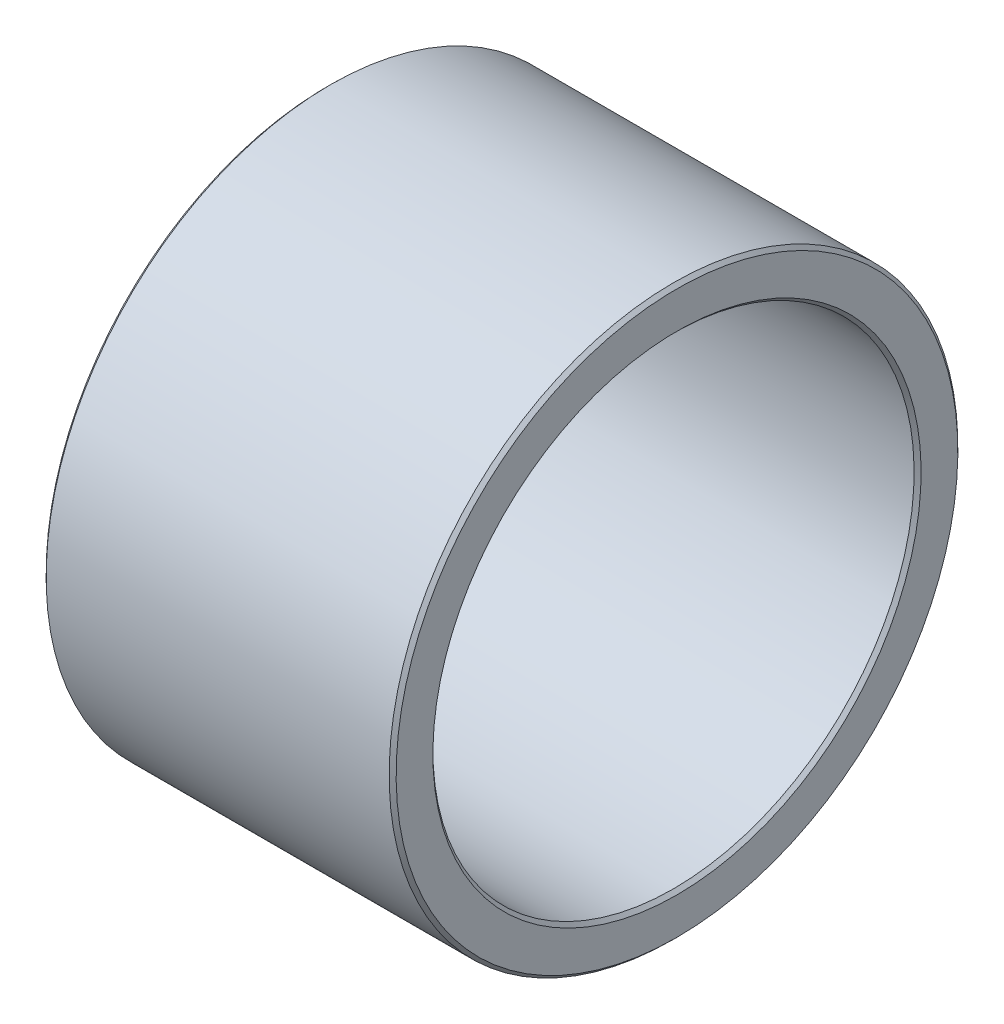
ISO-10303-21;
HEADER;
FILE_DESCRIPTION(('STEP AP214'),'2;1');
FILE_NAME('part.step','',(''),(''),'','','');
FILE_SCHEMA(('AUTOMOTIVE_DESIGN { 1 0 10303 214 1 1 1 1 }'));
ENDSEC;
DATA;
#1=APPLICATION_CONTEXT('core data for automotive mechanical design processes');
#2=APPLICATION_PROTOCOL_DEFINITION('international standard','automotive_design',2000,#1);
#3=PRODUCT_CONTEXT('',#1,'mechanical');
#4=PRODUCT('Part','Part','',(#3));
#5=PRODUCT_RELATED_PRODUCT_CATEGORY('part','',(#4));
#6=PRODUCT_DEFINITION_FORMATION('','',#4);
#7=PRODUCT_DEFINITION_CONTEXT('part definition',#1,'design');
#8=PRODUCT_DEFINITION('design','',#6,#7);
#9=PRODUCT_DEFINITION_SHAPE('','',#8);
#10=(LENGTH_UNIT() NAMED_UNIT(*) SI_UNIT(.MILLI.,.METRE.));
#11=(NAMED_UNIT(*) PLANE_ANGLE_UNIT() SI_UNIT($,.RADIAN.));
#12=(NAMED_UNIT(*) SI_UNIT($,.STERADIAN.) SOLID_ANGLE_UNIT());
#13=UNCERTAINTY_MEASURE_WITH_UNIT(LENGTH_MEASURE(1.E-05),#10,'distance_accuracy_value','');
#14=(GEOMETRIC_REPRESENTATION_CONTEXT(3) GLOBAL_UNCERTAINTY_ASSIGNED_CONTEXT((#13)) GLOBAL_UNIT_ASSIGNED_CONTEXT((#10,
#11,#12)) REPRESENTATION_CONTEXT('',''));
#15=CARTESIAN_POINT('',(0.,0.,0.));
#16=DIRECTION('',(0.,0.,1.));
#17=DIRECTION('',(1.,0.,0.));
#18=AXIS2_PLACEMENT_3D('',#15,#16,#17);
#19=CARTESIAN_POINT('',(0.,-30.,0.));
#20=DIRECTION('',(-1.,0.,0.));
#21=DIRECTION('',(0.,1.,0.));
#22=AXIS2_PLACEMENT_3D('',#19,#20,#21);
#23=PLANE('',#22);
#24=CARTESIAN_POINT('',(0.,0.,0.));
#25=DIRECTION('',(1.,0.,0.));
#26=DIRECTION('',(0.,-1.,0.));
#27=AXIS2_PLACEMENT_3D('',#24,#25,#26);
#28=CIRCLE('',#27,27.9);
#29=CARTESIAN_POINT('',(0.,-27.9,0.));
#30=VERTEX_POINT('',#29);
#31=EDGE_CURVE('E9',#30,#30,#28,.T.);
#32=ORIENTED_EDGE('',*,*,#31,.T.);
#33=EDGE_LOOP('',(#32));
#34=FACE_BOUND('',#33,.T.);
#35=CARTESIAN_POINT('',(0.,0.,0.));
#36=DIRECTION('',(1.,0.,0.));
#37=DIRECTION('',(0.,-1.,0.));
#38=AXIS2_PLACEMENT_3D('',#35,#36,#37);
#39=CIRCLE('',#38,32.1);
#40=CARTESIAN_POINT('',(0.,-32.1,0.));
#41=VERTEX_POINT('',#40);
#42=EDGE_CURVE('E53',#41,#41,#39,.T.);
#43=ORIENTED_EDGE('',*,*,#42,.F.);
#44=EDGE_LOOP('',(#43));
#45=FACE_BOUND('',#44,.T.);
#46=ADVANCED_FACE('F15',(#34,#45),#23,.T.);
#47=CARTESIAN_POINT('',(0.2,0.,0.));
#48=DIRECTION('',(-1.,0.,0.));
#49=DIRECTION('',(0.,-1.,0.));
#50=AXIS2_PLACEMENT_3D('',#47,#48,#49);
#51=CONICAL_SURFACE('',#50,27.7,0.78539816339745);
#52=CARTESIAN_POINT('',(0.4,0.,0.));
#53=DIRECTION('',(1.,0.,0.));
#54=DIRECTION('',(0.,-1.,0.));
#55=AXIS2_PLACEMENT_3D('',#52,#53,#54);
#56=CIRCLE('',#55,27.5);
#57=CARTESIAN_POINT('',(0.4,-27.5,0.));
#58=VERTEX_POINT('',#57);
#59=EDGE_CURVE('E22',#58,#58,#56,.T.);
#60=ORIENTED_EDGE('',*,*,#59,.T.);
#61=EDGE_LOOP('',(#60));
#62=FACE_BOUND('',#61,.T.);
#63=ORIENTED_EDGE('',*,*,#31,.F.);
#64=EDGE_LOOP('',(#63));
#65=FACE_BOUND('',#64,.T.);
#66=ADVANCED_FACE('F82',(#62,#65),#51,.F.);
#67=CARTESIAN_POINT('',(20.,0.,0.));
#68=DIRECTION('',(-1.,0.,0.));
#69=DIRECTION('',(0.,-1.,0.));
#70=AXIS2_PLACEMENT_3D('',#67,#68,#69);
#71=CYLINDRICAL_SURFACE('',#70,27.5);
#72=CARTESIAN_POINT('',(39.6,0.,0.));
#73=DIRECTION('',(1.,0.,0.));
#74=DIRECTION('',(0.,-1.,0.));
#75=AXIS2_PLACEMENT_3D('',#72,#73,#74);
#76=CIRCLE('',#75,27.5);
#77=CARTESIAN_POINT('',(39.6,-27.5,0.));
#78=VERTEX_POINT('',#77);
#79=EDGE_CURVE('E58',#78,#78,#76,.T.);
#80=ORIENTED_EDGE('',*,*,#79,.T.);
#81=EDGE_LOOP('',(#80));
#82=FACE_BOUND('',#81,.T.);
#83=ORIENTED_EDGE('',*,*,#59,.F.);
#84=EDGE_LOOP('',(#83));
#85=FACE_BOUND('',#84,.T.);
#86=ADVANCED_FACE('F66',(#82,#85),#71,.F.);
#87=CARTESIAN_POINT('',(39.8,0.,0.));
#88=DIRECTION('',(1.,0.,0.));
#89=DIRECTION('',(0.,-1.,0.));
#90=AXIS2_PLACEMENT_3D('',#87,#88,#89);
#91=CONICAL_SURFACE('',#90,27.7,0.785398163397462);
#92=CARTESIAN_POINT('',(40.,0.,0.));
#93=DIRECTION('',(1.,0.,0.));
#94=DIRECTION('',(0.,-1.,0.));
#95=AXIS2_PLACEMENT_3D('',#92,#93,#94);
#96=CIRCLE('',#95,27.9);
#97=CARTESIAN_POINT('',(40.,-27.9,0.));
#98=VERTEX_POINT('',#97);
#99=EDGE_CURVE('E63',#98,#98,#96,.T.);
#100=ORIENTED_EDGE('',*,*,#99,.T.);
#101=EDGE_LOOP('',(#100));
#102=FACE_BOUND('',#101,.T.);
#103=ORIENTED_EDGE('',*,*,#79,.F.);
#104=EDGE_LOOP('',(#103));
#105=FACE_BOUND('',#104,.T.);
#106=ADVANCED_FACE('F69',(#102,#105),#91,.F.);
#107=CARTESIAN_POINT('',(40.,-30.,0.));
#108=DIRECTION('',(1.,0.,0.));
#109=DIRECTION('',(0.,-1.,0.));
#110=AXIS2_PLACEMENT_3D('',#107,#108,#109);
#111=PLANE('',#110);
#112=CARTESIAN_POINT('',(40.,0.,0.));
#113=DIRECTION('',(1.,0.,0.));
#114=DIRECTION('',(0.,-1.,0.));
#115=AXIS2_PLACEMENT_3D('',#112,#113,#114);
#116=CIRCLE('',#115,32.1);
#117=CARTESIAN_POINT('',(40.,-32.1,0.));
#118=VERTEX_POINT('',#117);
#119=EDGE_CURVE('E61',#118,#118,#116,.T.);
#120=ORIENTED_EDGE('',*,*,#119,.T.);
#121=EDGE_LOOP('',(#120));
#122=FACE_BOUND('',#121,.T.);
#123=ORIENTED_EDGE('',*,*,#99,.F.);
#124=EDGE_LOOP('',(#123));
#125=FACE_BOUND('',#124,.T.);
#126=ADVANCED_FACE('F71',(#122,#125),#111,.T.);
#127=CARTESIAN_POINT('',(39.8,0.,0.));
#128=DIRECTION('',(-1.,0.,0.));
#129=DIRECTION('',(0.,-1.,0.));
#130=AXIS2_PLACEMENT_3D('',#127,#128,#129);
#131=CONICAL_SURFACE('',#130,32.3,0.785398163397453);
#132=CARTESIAN_POINT('',(39.6,0.,0.));
#133=DIRECTION('',(1.,0.,0.));
#134=DIRECTION('',(0.,-1.,0.));
#135=AXIS2_PLACEMENT_3D('',#132,#133,#134);
#136=CIRCLE('',#135,32.5);
#137=CARTESIAN_POINT('',(39.6,-32.5,0.));
#138=VERTEX_POINT('',#137);
#139=EDGE_CURVE('E55',#138,#138,#136,.T.);
#140=ORIENTED_EDGE('',*,*,#139,.T.);
#141=EDGE_LOOP('',(#140));
#142=FACE_BOUND('',#141,.T.);
#143=ORIENTED_EDGE('',*,*,#119,.F.);
#144=EDGE_LOOP('',(#143));
#145=FACE_BOUND('',#144,.T.);
#146=ADVANCED_FACE('F79',(#142,#145),#131,.T.);
#147=CARTESIAN_POINT('',(20.,0.,0.));
#148=DIRECTION('',(-1.,0.,0.));
#149=DIRECTION('',(0.,-1.,0.));
#150=AXIS2_PLACEMENT_3D('',#147,#148,#149);
#151=CYLINDRICAL_SURFACE('',#150,32.5);
#152=CARTESIAN_POINT('',(0.4,0.,0.));
#153=DIRECTION('',(1.,0.,0.));
#154=DIRECTION('',(0.,-1.,0.));
#155=AXIS2_PLACEMENT_3D('',#152,#153,#154);
#156=CIRCLE('',#155,32.5);
#157=CARTESIAN_POINT('',(0.4,-32.5,0.));
#158=VERTEX_POINT('',#157);
#159=EDGE_CURVE('E49',#158,#158,#156,.T.);
#160=ORIENTED_EDGE('',*,*,#159,.T.);
#161=EDGE_LOOP('',(#160));
#162=FACE_BOUND('',#161,.T.);
#163=ORIENTED_EDGE('',*,*,#139,.F.);
#164=EDGE_LOOP('',(#163));
#165=FACE_BOUND('',#164,.T.);
#166=ADVANCED_FACE('F50',(#162,#165),#151,.T.);
#167=CARTESIAN_POINT('',(0.2,0.,0.));
#168=DIRECTION('',(1.,0.,0.));
#169=DIRECTION('',(0.,-1.,0.));
#170=AXIS2_PLACEMENT_3D('',#167,#168,#169);
#171=CONICAL_SURFACE('',#170,32.3,0.785398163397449);
#172=ORIENTED_EDGE('',*,*,#42,.T.);
#173=EDGE_LOOP('',(#172));
#174=FACE_BOUND('',#173,.T.);
#175=ORIENTED_EDGE('',*,*,#159,.F.);
#176=EDGE_LOOP('',(#175));
#177=FACE_BOUND('',#176,.T.);
#178=ADVANCED_FACE('F92',(#174,#177),#171,.T.);
#179=CLOSED_SHELL('',(#46,#66,#86,#106,#126,#146,#166,#178));
#180=MANIFOLD_SOLID_BREP('B1',#179);
#181=ADVANCED_BREP_SHAPE_REPRESENTATION('',(#18,#180),#14);
#182=SHAPE_DEFINITION_REPRESENTATION(#9,#181);
ENDSEC;
END-ISO-10303-21;
